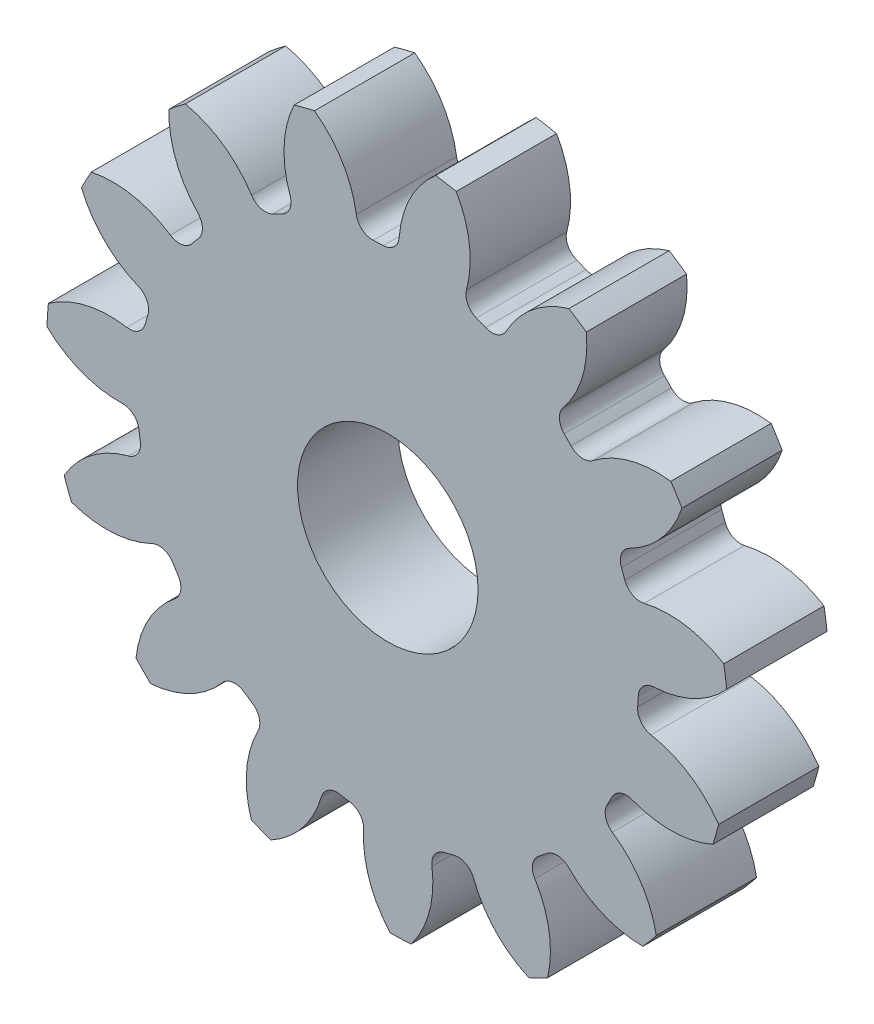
from build123d import *

# Parameters (mm, degrees)
SKETCH3_R         = 431.8
GEARBODY_DEPTH    = 127
TOOTHCUT_DEPTH    = 624.723881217
CIRPATTERN1_COUNT = 15
BOREDIA_R         = 114.3
BORE_DEPTH        = 12700


with BuildPart() as part:
    # Sketch3 → gearBody (new body)
    with BuildSketch(Plane.XY):
        Circle(SKETCH3_R)
    extrude(amount=GEARBODY_DEPTH)

    # Sketch2 → toothCut (cut, through all)
    with BuildSketch(Plane.XY):
        with BuildLine():
            ThreePointArc((316.314685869, -27.409295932), (316.79152663, -21.198553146), (317.146433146, -14.979650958))
            ThreePointArc((317.146433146, -14.979650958), (323.188497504, -1.325929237), (336.849930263, 4.698679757))
            ThreePointArc((336.849930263, 4.698679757), (389.185961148, 18.136903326), (431.8, 51.358728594))
            ThreePointArc((431.8, 51.358728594), (433.873287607, -29.033244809), (421.107361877, -108.43223126))
            ThreePointArc((421.107361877, -108.43223126), (383.299607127, -69.828867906), (333.220646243, -49.537400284))
            ThreePointArc((333.220646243, -49.537400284), (320.483710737, -41.746307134), (316.314685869, -27.409295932))
        make_face()
    toothcut = extrude(amount=TOOTHCUT_DEPTH, mode=Mode.SUBTRACT)

    # CirPattern1: toothCut ×15 about axis
    cirpattern1_axis = Axis((0, 0, 0), (0, 0, 1))
    for i in range(1, CIRPATTERN1_COUNT):
        add(toothcut.rotate(cirpattern1_axis, i * 360 / CIRPATTERN1_COUNT), mode=Mode.SUBTRACT)

    # boreDia → bore (cut, symmetric)
    with BuildSketch(Plane.XY):
        Circle(BOREDIA_R)
    extrude(amount=BORE_DEPTH, both=True, mode=Mode.SUBTRACT)


solid = part.part
